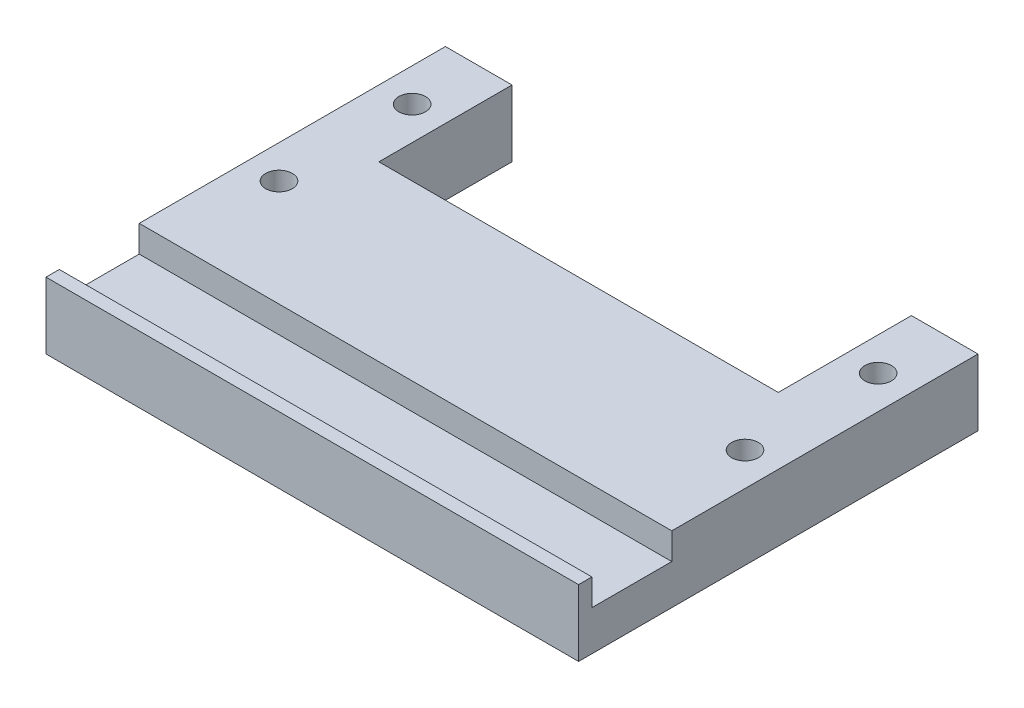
ISO-10303-21;
HEADER;
FILE_DESCRIPTION(('STEP AP214'),'2;1');
FILE_NAME('part.step','',(''),(''),'','','');
FILE_SCHEMA(('AUTOMOTIVE_DESIGN { 1 0 10303 214 1 1 1 1 }'));
ENDSEC;
DATA;
#1=APPLICATION_CONTEXT('core data for automotive mechanical design processes');
#2=APPLICATION_PROTOCOL_DEFINITION('international standard','automotive_design',2000,#1);
#3=PRODUCT_CONTEXT('',#1,'mechanical');
#4=PRODUCT('Part','Part','',(#3));
#5=PRODUCT_RELATED_PRODUCT_CATEGORY('part','',(#4));
#6=PRODUCT_DEFINITION_FORMATION('','',#4);
#7=PRODUCT_DEFINITION_CONTEXT('part definition',#1,'design');
#8=PRODUCT_DEFINITION('design','',#6,#7);
#9=PRODUCT_DEFINITION_SHAPE('','',#8);
#10=(LENGTH_UNIT() NAMED_UNIT(*) SI_UNIT(.MILLI.,.METRE.));
#11=(NAMED_UNIT(*) PLANE_ANGLE_UNIT() SI_UNIT($,.RADIAN.));
#12=(NAMED_UNIT(*) SI_UNIT($,.STERADIAN.) SOLID_ANGLE_UNIT());
#13=UNCERTAINTY_MEASURE_WITH_UNIT(LENGTH_MEASURE(1.E-05),#10,'distance_accuracy_value','');
#14=(GEOMETRIC_REPRESENTATION_CONTEXT(3) GLOBAL_UNCERTAINTY_ASSIGNED_CONTEXT((#13)) GLOBAL_UNIT_ASSIGNED_CONTEXT((#10,
#11,#12)) REPRESENTATION_CONTEXT('',''));
#15=CARTESIAN_POINT('',(0.,0.,0.));
#16=DIRECTION('',(0.,0.,1.));
#17=DIRECTION('',(1.,0.,0.));
#18=AXIS2_PLACEMENT_3D('',#15,#16,#17);
#19=CARTESIAN_POINT('',(0.,6.35,0.));
#20=DIRECTION('',(0.,1.,0.));
#21=DIRECTION('',(0.,0.,1.));
#22=AXIS2_PLACEMENT_3D('',#19,#20,#21);
#23=PLANE('',#22);
#24=DIRECTION('',(1.,0.,0.));
#25=VECTOR('',#24,1.);
#26=CARTESIAN_POINT('',(0.,6.35,11.43));
#27=LINE('',#26,#25);
#28=CARTESIAN_POINT('',(-25.4,6.35,11.43));
#29=VERTEX_POINT('',#28);
#30=CARTESIAN_POINT('',(25.4,6.35,11.43));
#31=VERTEX_POINT('',#30);
#32=EDGE_CURVE('E44',#29,#31,#27,.T.);
#33=ORIENTED_EDGE('',*,*,#32,.F.);
#34=DIRECTION('',(0.,0.,1.));
#35=VECTOR('',#34,1.);
#36=CARTESIAN_POINT('',(-25.4,6.35,-12.7));
#37=LINE('',#36,#35);
#38=CARTESIAN_POINT('',(-25.4,6.35,12.7));
#39=VERTEX_POINT('',#38);
#40=EDGE_CURVE('E275',#29,#39,#37,.T.);
#41=ORIENTED_EDGE('',*,*,#40,.T.);
#42=DIRECTION('',(1.,0.,0.));
#43=VECTOR('',#42,1.);
#44=CARTESIAN_POINT('',(-25.4,6.35,12.7));
#45=LINE('',#44,#43);
#46=CARTESIAN_POINT('',(25.4,6.35,12.7));
#47=VERTEX_POINT('',#46);
#48=EDGE_CURVE('E279',#39,#47,#45,.T.);
#49=ORIENTED_EDGE('',*,*,#48,.T.);
#50=DIRECTION('',(0.,0.,-1.));
#51=VECTOR('',#50,1.);
#52=CARTESIAN_POINT('',(25.4,6.35,-12.7));
#53=LINE('',#52,#51);
#54=EDGE_CURVE('E268',#47,#31,#53,.T.);
#55=ORIENTED_EDGE('',*,*,#54,.T.);
#56=EDGE_LOOP('',(#33,#41,#49,#55));
#57=FACE_BOUND('',#56,.T.);
#58=ADVANCED_FACE('F36',(#57),#23,.T.);
#59=CARTESIAN_POINT('',(-25.4,6.35,-12.7));
#60=DIRECTION('',(0.,0.,1.));
#61=DIRECTION('',(1.,0.,0.));
#62=AXIS2_PLACEMENT_3D('',#59,#60,#61);
#63=PLANE('',#62);
#64=DIRECTION('',(0.,-1.,0.));
#65=VECTOR('',#64,1.);
#66=CARTESIAN_POINT('',(-19.05,6.35,-12.7));
#67=LINE('',#66,#65);
#68=CARTESIAN_POINT('',(-19.05,6.35,-12.7));
#69=VERTEX_POINT('',#68);
#70=CARTESIAN_POINT('',(-19.05,0.,-12.7));
#71=VERTEX_POINT('',#70);
#72=EDGE_CURVE('E227',#69,#71,#67,.T.);
#73=ORIENTED_EDGE('',*,*,#72,.F.);
#74=DIRECTION('',(-1.,0.,0.));
#75=VECTOR('',#74,1.);
#76=CARTESIAN_POINT('',(-25.4,6.35,-12.7));
#77=LINE('',#76,#75);
#78=CARTESIAN_POINT('',(19.05,6.35,-12.7));
#79=VERTEX_POINT('',#78);
#80=EDGE_CURVE('E271',#79,#69,#77,.T.);
#81=ORIENTED_EDGE('',*,*,#80,.F.);
#82=DIRECTION('',(0.,1.,0.));
#83=VECTOR('',#82,1.);
#84=CARTESIAN_POINT('',(19.05,6.35,-12.7));
#85=LINE('',#84,#83);
#86=CARTESIAN_POINT('',(19.05,0.,-12.7));
#87=VERTEX_POINT('',#86);
#88=EDGE_CURVE('E248',#87,#79,#85,.T.);
#89=ORIENTED_EDGE('',*,*,#88,.F.);
#90=DIRECTION('',(-1.,0.,0.));
#91=VECTOR('',#90,1.);
#92=CARTESIAN_POINT('',(-25.4,0.,-12.7));
#93=LINE('',#92,#91);
#94=EDGE_CURVE('E283',#87,#71,#93,.T.);
#95=ORIENTED_EDGE('',*,*,#94,.T.);
#96=EDGE_LOOP('',(#73,#81,#89,#95));
#97=FACE_BOUND('',#96,.T.);
#98=ADVANCED_FACE('F346',(#97),#63,.F.);
#99=CARTESIAN_POINT('',(25.4,6.35,-12.7));
#100=DIRECTION('',(-1.,0.,0.));
#101=DIRECTION('',(0.,0.,1.));
#102=AXIS2_PLACEMENT_3D('',#99,#100,#101);
#103=PLANE('',#102);
#104=DIRECTION('',(0.,0.,-1.));
#105=VECTOR('',#104,1.);
#106=CARTESIAN_POINT('',(25.4,3.81,-12.7));
#107=LINE('',#106,#105);
#108=CARTESIAN_POINT('',(25.4,3.81,11.43));
#109=VERTEX_POINT('',#108);
#110=CARTESIAN_POINT('',(25.4,3.81,3.81));
#111=VERTEX_POINT('',#110);
#112=EDGE_CURVE('E203',#109,#111,#107,.T.);
#113=ORIENTED_EDGE('',*,*,#112,.F.);
#114=DIRECTION('',(0.,1.,0.));
#115=VECTOR('',#114,1.);
#116=CARTESIAN_POINT('',(25.4,6.35,11.43));
#117=LINE('',#116,#115);
#118=EDGE_CURVE('E200',#109,#31,#117,.T.);
#119=ORIENTED_EDGE('',*,*,#118,.T.);
#120=ORIENTED_EDGE('',*,*,#54,.F.);
#121=DIRECTION('',(0.,-1.,0.));
#122=VECTOR('',#121,1.);
#123=CARTESIAN_POINT('',(25.4,6.35,12.7));
#124=LINE('',#123,#122);
#125=CARTESIAN_POINT('',(25.4,0.,12.7));
#126=VERTEX_POINT('',#125);
#127=EDGE_CURVE('E281',#47,#126,#124,.T.);
#128=ORIENTED_EDGE('',*,*,#127,.T.);
#129=DIRECTION('',(0.,0.,-1.));
#130=VECTOR('',#129,1.);
#131=CARTESIAN_POINT('',(25.4,0.,-12.7));
#132=LINE('',#131,#130);
#133=CARTESIAN_POINT('',(25.4,0.,-25.4));
#134=VERTEX_POINT('',#133);
#135=EDGE_CURVE('E267',#126,#134,#132,.T.);
#136=ORIENTED_EDGE('',*,*,#135,.T.);
#137=DIRECTION('',(0.,-1.,0.));
#138=VECTOR('',#137,1.);
#139=CARTESIAN_POINT('',(25.4,6.35,-25.4));
#140=LINE('',#139,#138);
#141=CARTESIAN_POINT('',(25.4,6.35,-25.4));
#142=VERTEX_POINT('',#141);
#143=EDGE_CURVE('E249',#142,#134,#140,.T.);
#144=ORIENTED_EDGE('',*,*,#143,.F.);
#145=CARTESIAN_POINT('',(25.4,6.35,3.80999999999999));
#146=VERTEX_POINT('',#145);
#147=EDGE_CURVE('E272',#146,#142,#53,.T.);
#148=ORIENTED_EDGE('',*,*,#147,.F.);
#149=DIRECTION('',(0.,-1.,0.));
#150=VECTOR('',#149,1.);
#151=CARTESIAN_POINT('',(25.4,6.35,3.81));
#152=LINE('',#151,#150);
#153=EDGE_CURVE('E59',#146,#111,#152,.T.);
#154=ORIENTED_EDGE('',*,*,#153,.T.);
#155=EDGE_LOOP('',(#113,#119,#120,#128,#136,#144,#148,#154));
#156=FACE_BOUND('',#155,.T.);
#157=ADVANCED_FACE('F38',(#156),#103,.F.);
#158=CARTESIAN_POINT('',(-25.4,6.35,-12.7));
#159=DIRECTION('',(1.,0.,0.));
#160=DIRECTION('',(0.,0.,-1.));
#161=AXIS2_PLACEMENT_3D('',#158,#159,#160);
#162=PLANE('',#161);
#163=ORIENTED_EDGE('',*,*,#40,.F.);
#164=DIRECTION('',(0.,-1.,0.));
#165=VECTOR('',#164,1.);
#166=CARTESIAN_POINT('',(-25.4,6.35,11.43));
#167=LINE('',#166,#165);
#168=CARTESIAN_POINT('',(-25.4,3.81,11.43));
#169=VERTEX_POINT('',#168);
#170=EDGE_CURVE('E197',#29,#169,#167,.T.);
#171=ORIENTED_EDGE('',*,*,#170,.T.);
#172=DIRECTION('',(0.,0.,1.));
#173=VECTOR('',#172,1.);
#174=CARTESIAN_POINT('',(-25.4,3.81,-12.7));
#175=LINE('',#174,#173);
#176=CARTESIAN_POINT('',(-25.4,3.81,3.81));
#177=VERTEX_POINT('',#176);
#178=EDGE_CURVE('E12',#177,#169,#175,.T.);
#179=ORIENTED_EDGE('',*,*,#178,.F.);
#180=DIRECTION('',(0.,1.,0.));
#181=VECTOR('',#180,1.);
#182=CARTESIAN_POINT('',(-25.4,6.35,3.81));
#183=LINE('',#182,#181);
#184=CARTESIAN_POINT('',(-25.4,6.35,3.81));
#185=VERTEX_POINT('',#184);
#186=EDGE_CURVE('E193',#177,#185,#183,.T.);
#187=ORIENTED_EDGE('',*,*,#186,.T.);
#188=CARTESIAN_POINT('',(-25.4,6.35,-25.4));
#189=VERTEX_POINT('',#188);
#190=EDGE_CURVE('E276',#189,#185,#37,.T.);
#191=ORIENTED_EDGE('',*,*,#190,.F.);
#192=DIRECTION('',(0.,1.,0.));
#193=VECTOR('',#192,1.);
#194=CARTESIAN_POINT('',(-25.4,6.35,-25.4));
#195=LINE('',#194,#193);
#196=CARTESIAN_POINT('',(-25.4,0.,-25.4));
#197=VERTEX_POINT('',#196);
#198=EDGE_CURVE('E230',#197,#189,#195,.T.);
#199=ORIENTED_EDGE('',*,*,#198,.F.);
#200=DIRECTION('',(0.,0.,1.));
#201=VECTOR('',#200,1.);
#202=CARTESIAN_POINT('',(-25.4,0.,-12.7));
#203=LINE('',#202,#201);
#204=CARTESIAN_POINT('',(-25.4,0.,12.7));
#205=VERTEX_POINT('',#204);
#206=EDGE_CURVE('E285',#197,#205,#203,.T.);
#207=ORIENTED_EDGE('',*,*,#206,.T.);
#208=DIRECTION('',(0.,-1.,0.));
#209=VECTOR('',#208,1.);
#210=CARTESIAN_POINT('',(-25.4,6.35,12.7));
#211=LINE('',#210,#209);
#212=EDGE_CURVE('E291',#39,#205,#211,.T.);
#213=ORIENTED_EDGE('',*,*,#212,.F.);
#214=EDGE_LOOP('',(#163,#171,#179,#187,#191,#199,#207,#213));
#215=FACE_BOUND('',#214,.T.);
#216=ADVANCED_FACE('F329',(#215),#162,.F.);
#217=CARTESIAN_POINT('',(-25.4,6.35,12.7));
#218=DIRECTION('',(0.,0.,-1.));
#219=DIRECTION('',(-1.,0.,0.));
#220=AXIS2_PLACEMENT_3D('',#217,#218,#219);
#221=PLANE('',#220);
#222=DIRECTION('',(1.,0.,0.));
#223=VECTOR('',#222,1.);
#224=CARTESIAN_POINT('',(-25.4,0.,12.7));
#225=LINE('',#224,#223);
#226=EDGE_CURVE('E287',#205,#126,#225,.T.);
#227=ORIENTED_EDGE('',*,*,#226,.T.);
#228=ORIENTED_EDGE('',*,*,#127,.F.);
#229=ORIENTED_EDGE('',*,*,#48,.F.);
#230=ORIENTED_EDGE('',*,*,#212,.T.);
#231=EDGE_LOOP('',(#227,#228,#229,#230));
#232=FACE_BOUND('',#231,.T.);
#233=ADVANCED_FACE('F308',(#232),#221,.F.);
#234=DIRECTION('',(-1.,0.,0.));
#235=VECTOR('',#234,1.);
#236=CARTESIAN_POINT('',(0.,6.35,3.81));
#237=LINE('',#236,#235);
#238=EDGE_CURVE('E294',#146,#185,#237,.T.);
#239=ORIENTED_EDGE('',*,*,#238,.F.);
#240=ORIENTED_EDGE('',*,*,#147,.T.);
#241=DIRECTION('',(1.,0.,0.));
#242=VECTOR('',#241,1.);
#243=CARTESIAN_POINT('',(25.4,6.35,-25.4));
#244=LINE('',#243,#242);
#245=CARTESIAN_POINT('',(19.05,6.35,-25.4));
#246=VERTEX_POINT('',#245);
#247=EDGE_CURVE('E256',#246,#142,#244,.T.);
#248=ORIENTED_EDGE('',*,*,#247,.F.);
#249=DIRECTION('',(0.,0.,1.));
#250=VECTOR('',#249,1.);
#251=CARTESIAN_POINT('',(19.05,6.35,-25.4));
#252=LINE('',#251,#250);
#253=EDGE_CURVE('E259',#246,#79,#252,.T.);
#254=ORIENTED_EDGE('',*,*,#253,.T.);
#255=ORIENTED_EDGE('',*,*,#80,.T.);
#256=DIRECTION('',(0.,0.,1.));
#257=VECTOR('',#256,1.);
#258=CARTESIAN_POINT('',(-19.05,6.35,-25.4));
#259=LINE('',#258,#257);
#260=CARTESIAN_POINT('',(-19.05,6.35,-25.4));
#261=VERTEX_POINT('',#260);
#262=EDGE_CURVE('E245',#261,#69,#259,.T.);
#263=ORIENTED_EDGE('',*,*,#262,.F.);
#264=DIRECTION('',(1.,0.,0.));
#265=VECTOR('',#264,1.);
#266=CARTESIAN_POINT('',(-25.4,6.35,-25.4));
#267=LINE('',#266,#265);
#268=EDGE_CURVE('E233',#189,#261,#267,.T.);
#269=ORIENTED_EDGE('',*,*,#268,.F.);
#270=ORIENTED_EDGE('',*,*,#190,.T.);
#271=EDGE_LOOP('',(#239,#240,#248,#254,#255,#263,#269,#270));
#272=FACE_BOUND('',#271,.T.);
#273=CARTESIAN_POINT('',(-22.225,6.35,-19.05));
#274=DIRECTION('',(0.,1.,0.));
#275=DIRECTION('',(0.,0.,1.));
#276=AXIS2_PLACEMENT_3D('',#273,#274,#275);
#277=CIRCLE('',#276,1.27);
#278=CARTESIAN_POINT('',(-22.225,6.35,-17.78));
#279=VERTEX_POINT('',#278);
#280=EDGE_CURVE('E216',#279,#279,#277,.T.);
#281=ORIENTED_EDGE('',*,*,#280,.F.);
#282=EDGE_LOOP('',(#281));
#283=FACE_BOUND('',#282,.T.);
#284=CARTESIAN_POINT('',(22.225,6.35,-6.35));
#285=DIRECTION('',(0.,1.,0.));
#286=DIRECTION('',(0.,0.,-1.));
#287=AXIS2_PLACEMENT_3D('',#284,#285,#286);
#288=CIRCLE('',#287,1.27);
#289=CARTESIAN_POINT('',(22.225,6.35,-7.62));
#290=VERTEX_POINT('',#289);
#291=EDGE_CURVE('E209',#290,#290,#288,.T.);
#292=ORIENTED_EDGE('',*,*,#291,.F.);
#293=EDGE_LOOP('',(#292));
#294=FACE_BOUND('',#293,.T.);
#295=CARTESIAN_POINT('',(22.225,6.35,-19.05));
#296=DIRECTION('',(0.,1.,0.));
#297=DIRECTION('',(0.,0.,-1.));
#298=AXIS2_PLACEMENT_3D('',#295,#296,#297);
#299=CIRCLE('',#298,1.27);
#300=CARTESIAN_POINT('',(22.225,6.35,-20.32));
#301=VERTEX_POINT('',#300);
#302=EDGE_CURVE('E205',#301,#301,#299,.T.);
#303=ORIENTED_EDGE('',*,*,#302,.F.);
#304=EDGE_LOOP('',(#303));
#305=FACE_BOUND('',#304,.T.);
#306=CARTESIAN_POINT('',(-22.225,6.35,-6.35));
#307=DIRECTION('',(0.,1.,0.));
#308=DIRECTION('',(0.,0.,1.));
#309=AXIS2_PLACEMENT_3D('',#306,#307,#308);
#310=CIRCLE('',#309,1.27);
#311=CARTESIAN_POINT('',(-22.225,6.35,-5.08));
#312=VERTEX_POINT('',#311);
#313=EDGE_CURVE('E215',#312,#312,#310,.T.);
#314=ORIENTED_EDGE('',*,*,#313,.F.);
#315=EDGE_LOOP('',(#314));
#316=FACE_BOUND('',#315,.T.);
#317=ADVANCED_FACE('F323',(#272,#283,#294,#305,#316),#23,.T.);
#318=CARTESIAN_POINT('',(0.,0.,0.));
#319=DIRECTION('',(0.,1.,0.));
#320=DIRECTION('',(0.,0.,1.));
#321=AXIS2_PLACEMENT_3D('',#318,#319,#320);
#322=PLANE('',#321);
#323=DIRECTION('',(0.,0.,1.));
#324=VECTOR('',#323,1.);
#325=CARTESIAN_POINT('',(20.32,0.,2.54));
#326=LINE('',#325,#324);
#327=CARTESIAN_POINT('',(20.32,0.,-11.43));
#328=VERTEX_POINT('',#327);
#329=CARTESIAN_POINT('',(20.32,0.,2.54));
#330=VERTEX_POINT('',#329);
#331=EDGE_CURVE('E173',#328,#330,#326,.T.);
#332=ORIENTED_EDGE('',*,*,#331,.F.);
#333=DIRECTION('',(1.,0.,0.));
#334=VECTOR('',#333,1.);
#335=CARTESIAN_POINT('',(-20.32,0.,-11.43));
#336=LINE('',#335,#334);
#337=CARTESIAN_POINT('',(-20.32,0.,-11.43));
#338=VERTEX_POINT('',#337);
#339=EDGE_CURVE('E166',#338,#328,#336,.T.);
#340=ORIENTED_EDGE('',*,*,#339,.F.);
#341=DIRECTION('',(0.,0.,-1.));
#342=VECTOR('',#341,1.);
#343=CARTESIAN_POINT('',(-20.32,0.,2.54));
#344=LINE('',#343,#342);
#345=CARTESIAN_POINT('',(-20.32,0.,2.54));
#346=VERTEX_POINT('',#345);
#347=EDGE_CURVE('E177',#346,#338,#344,.T.);
#348=ORIENTED_EDGE('',*,*,#347,.F.);
#349=DIRECTION('',(-1.,0.,0.));
#350=VECTOR('',#349,1.);
#351=CARTESIAN_POINT('',(-20.32,0.,2.54));
#352=LINE('',#351,#350);
#353=EDGE_CURVE('E51',#330,#346,#352,.T.);
#354=ORIENTED_EDGE('',*,*,#353,.F.);
#355=EDGE_LOOP('',(#332,#340,#348,#354));
#356=FACE_BOUND('',#355,.T.);
#357=CARTESIAN_POINT('',(-22.225,0.,-19.05));
#358=DIRECTION('',(0.,1.,0.));
#359=DIRECTION('',(0.,0.,1.));
#360=AXIS2_PLACEMENT_3D('',#357,#358,#359);
#361=CIRCLE('',#360,1.27);
#362=CARTESIAN_POINT('',(-22.225,0.,-17.78));
#363=VERTEX_POINT('',#362);
#364=EDGE_CURVE('E212',#363,#363,#361,.T.);
#365=ORIENTED_EDGE('',*,*,#364,.T.);
#366=EDGE_LOOP('',(#365));
#367=FACE_BOUND('',#366,.T.);
#368=CARTESIAN_POINT('',(22.225,0.,-6.35));
#369=DIRECTION('',(0.,1.,0.));
#370=DIRECTION('',(0.,0.,-1.));
#371=AXIS2_PLACEMENT_3D('',#368,#369,#370);
#372=CIRCLE('',#371,1.27);
#373=CARTESIAN_POINT('',(22.225,0.,-7.62));
#374=VERTEX_POINT('',#373);
#375=EDGE_CURVE('E219',#374,#374,#372,.T.);
#376=ORIENTED_EDGE('',*,*,#375,.T.);
#377=EDGE_LOOP('',(#376));
#378=FACE_BOUND('',#377,.T.);
#379=CARTESIAN_POINT('',(22.225,0.,-19.05));
#380=DIRECTION('',(0.,1.,0.));
#381=DIRECTION('',(0.,0.,-1.));
#382=AXIS2_PLACEMENT_3D('',#379,#380,#381);
#383=CIRCLE('',#382,1.27);
#384=CARTESIAN_POINT('',(22.225,0.,-20.32));
#385=VERTEX_POINT('',#384);
#386=EDGE_CURVE('E206',#385,#385,#383,.T.);
#387=ORIENTED_EDGE('',*,*,#386,.T.);
#388=EDGE_LOOP('',(#387));
#389=FACE_BOUND('',#388,.T.);
#390=CARTESIAN_POINT('',(-22.225,0.,-6.35));
#391=DIRECTION('',(0.,1.,0.));
#392=DIRECTION('',(0.,0.,1.));
#393=AXIS2_PLACEMENT_3D('',#390,#391,#392);
#394=CIRCLE('',#393,1.27);
#395=CARTESIAN_POINT('',(-22.225,0.,-5.08));
#396=VERTEX_POINT('',#395);
#397=EDGE_CURVE('E224',#396,#396,#394,.T.);
#398=ORIENTED_EDGE('',*,*,#397,.T.);
#399=EDGE_LOOP('',(#398));
#400=FACE_BOUND('',#399,.T.);
#401=ORIENTED_EDGE('',*,*,#135,.F.);
#402=ORIENTED_EDGE('',*,*,#226,.F.);
#403=ORIENTED_EDGE('',*,*,#206,.F.);
#404=DIRECTION('',(-1.,0.,0.));
#405=VECTOR('',#404,1.);
#406=CARTESIAN_POINT('',(-25.4,0.,-25.4));
#407=LINE('',#406,#405);
#408=CARTESIAN_POINT('',(-19.05,0.,-25.4));
#409=VERTEX_POINT('',#408);
#410=EDGE_CURVE('E237',#409,#197,#407,.T.);
#411=ORIENTED_EDGE('',*,*,#410,.F.);
#412=DIRECTION('',(0.,0.,1.));
#413=VECTOR('',#412,1.);
#414=CARTESIAN_POINT('',(-19.05,0.,-25.4));
#415=LINE('',#414,#413);
#416=EDGE_CURVE('E240',#409,#71,#415,.T.);
#417=ORIENTED_EDGE('',*,*,#416,.T.);
#418=ORIENTED_EDGE('',*,*,#94,.F.);
#419=DIRECTION('',(0.,0.,1.));
#420=VECTOR('',#419,1.);
#421=CARTESIAN_POINT('',(19.05,0.,-25.4));
#422=LINE('',#421,#420);
#423=CARTESIAN_POINT('',(19.05,0.,-25.4));
#424=VERTEX_POINT('',#423);
#425=EDGE_CURVE('E264',#424,#87,#422,.T.);
#426=ORIENTED_EDGE('',*,*,#425,.F.);
#427=DIRECTION('',(-1.,0.,0.));
#428=VECTOR('',#427,1.);
#429=CARTESIAN_POINT('',(25.4,0.,-25.4));
#430=LINE('',#429,#428);
#431=EDGE_CURVE('E252',#134,#424,#430,.T.);
#432=ORIENTED_EDGE('',*,*,#431,.F.);
#433=EDGE_LOOP('',(#401,#402,#403,#411,#417,#418,#426,#432));
#434=FACE_BOUND('',#433,.T.);
#435=ADVANCED_FACE('F314',(#356,#367,#378,#389,#400,#434),#322,.F.);
#436=CARTESIAN_POINT('',(19.05,6.35,-25.4));
#437=DIRECTION('',(1.,0.,0.));
#438=DIRECTION('',(0.,0.,-1.));
#439=AXIS2_PLACEMENT_3D('',#436,#437,#438);
#440=PLANE('',#439);
#441=ORIENTED_EDGE('',*,*,#88,.T.);
#442=ORIENTED_EDGE('',*,*,#253,.F.);
#443=DIRECTION('',(0.,1.,0.));
#444=VECTOR('',#443,1.);
#445=CARTESIAN_POINT('',(19.05,6.35,-25.4));
#446=LINE('',#445,#444);
#447=EDGE_CURVE('E254',#424,#246,#446,.T.);
#448=ORIENTED_EDGE('',*,*,#447,.F.);
#449=ORIENTED_EDGE('',*,*,#425,.T.);
#450=EDGE_LOOP('',(#441,#442,#448,#449));
#451=FACE_BOUND('',#450,.T.);
#452=ADVANCED_FACE('F359',(#451),#440,.F.);
#453=CARTESIAN_POINT('',(0.,0.,-25.4));
#454=DIRECTION('',(0.,0.,-1.));
#455=DIRECTION('',(-1.,0.,0.));
#456=AXIS2_PLACEMENT_3D('',#453,#454,#455);
#457=PLANE('',#456);
#458=ORIENTED_EDGE('',*,*,#143,.T.);
#459=ORIENTED_EDGE('',*,*,#431,.T.);
#460=ORIENTED_EDGE('',*,*,#447,.T.);
#461=ORIENTED_EDGE('',*,*,#247,.T.);
#462=EDGE_LOOP('',(#458,#459,#460,#461));
#463=FACE_BOUND('',#462,.T.);
#464=ADVANCED_FACE('F319',(#463),#457,.T.);
#465=CARTESIAN_POINT('',(-19.05,6.35,-25.4));
#466=DIRECTION('',(-1.,0.,0.));
#467=DIRECTION('',(0.,0.,1.));
#468=AXIS2_PLACEMENT_3D('',#465,#466,#467);
#469=PLANE('',#468);
#470=ORIENTED_EDGE('',*,*,#72,.T.);
#471=ORIENTED_EDGE('',*,*,#416,.F.);
#472=DIRECTION('',(0.,-1.,0.));
#473=VECTOR('',#472,1.);
#474=CARTESIAN_POINT('',(-19.05,6.35,-25.4));
#475=LINE('',#474,#473);
#476=EDGE_CURVE('E235',#261,#409,#475,.T.);
#477=ORIENTED_EDGE('',*,*,#476,.F.);
#478=ORIENTED_EDGE('',*,*,#262,.T.);
#479=EDGE_LOOP('',(#470,#471,#477,#478));
#480=FACE_BOUND('',#479,.T.);
#481=ADVANCED_FACE('F396',(#480),#469,.F.);
#482=CARTESIAN_POINT('',(0.,0.,-25.4));
#483=DIRECTION('',(0.,0.,1.));
#484=DIRECTION('',(1.,0.,0.));
#485=AXIS2_PLACEMENT_3D('',#482,#483,#484);
#486=PLANE('',#485);
#487=ORIENTED_EDGE('',*,*,#198,.T.);
#488=ORIENTED_EDGE('',*,*,#268,.T.);
#489=ORIENTED_EDGE('',*,*,#476,.T.);
#490=ORIENTED_EDGE('',*,*,#410,.T.);
#491=EDGE_LOOP('',(#487,#488,#489,#490));
#492=FACE_BOUND('',#491,.T.);
#493=ADVANCED_FACE('F405',(#492),#486,.F.);
#494=CARTESIAN_POINT('',(-22.225,0.,-6.35));
#495=DIRECTION('',(0.,1.,0.));
#496=DIRECTION('',(0.,0.,1.));
#497=AXIS2_PLACEMENT_3D('',#494,#495,#496);
#498=CYLINDRICAL_SURFACE('',#497,1.27);
#499=ORIENTED_EDGE('',*,*,#397,.F.);
#500=EDGE_LOOP('',(#499));
#501=FACE_BOUND('',#500,.T.);
#502=ORIENTED_EDGE('',*,*,#313,.T.);
#503=EDGE_LOOP('',(#502));
#504=FACE_BOUND('',#503,.T.);
#505=ADVANCED_FACE('F415',(#501,#504),#498,.F.);
#506=CARTESIAN_POINT('',(22.225,0.,-19.05));
#507=DIRECTION('',(0.,1.,0.));
#508=DIRECTION('',(0.,0.,1.));
#509=AXIS2_PLACEMENT_3D('',#506,#507,#508);
#510=CYLINDRICAL_SURFACE('',#509,1.27);
#511=ORIENTED_EDGE('',*,*,#386,.F.);
#512=EDGE_LOOP('',(#511));
#513=FACE_BOUND('',#512,.T.);
#514=ORIENTED_EDGE('',*,*,#302,.T.);
#515=EDGE_LOOP('',(#514));
#516=FACE_BOUND('',#515,.T.);
#517=ADVANCED_FACE('F425',(#513,#516),#510,.F.);
#518=CARTESIAN_POINT('',(22.225,0.,-6.35));
#519=DIRECTION('',(0.,1.,0.));
#520=DIRECTION('',(0.,0.,1.));
#521=AXIS2_PLACEMENT_3D('',#518,#519,#520);
#522=CYLINDRICAL_SURFACE('',#521,1.27);
#523=ORIENTED_EDGE('',*,*,#375,.F.);
#524=EDGE_LOOP('',(#523));
#525=FACE_BOUND('',#524,.T.);
#526=ORIENTED_EDGE('',*,*,#291,.T.);
#527=EDGE_LOOP('',(#526));
#528=FACE_BOUND('',#527,.T.);
#529=ADVANCED_FACE('F341',(#525,#528),#522,.F.);
#530=CARTESIAN_POINT('',(-22.225,0.,-19.05));
#531=DIRECTION('',(0.,1.,0.));
#532=DIRECTION('',(0.,0.,1.));
#533=AXIS2_PLACEMENT_3D('',#530,#531,#532);
#534=CYLINDRICAL_SURFACE('',#533,1.27);
#535=ORIENTED_EDGE('',*,*,#364,.F.);
#536=EDGE_LOOP('',(#535));
#537=FACE_BOUND('',#536,.T.);
#538=ORIENTED_EDGE('',*,*,#280,.T.);
#539=EDGE_LOOP('',(#538));
#540=FACE_BOUND('',#539,.T.);
#541=ADVANCED_FACE('F334',(#537,#540),#534,.F.);
#542=CARTESIAN_POINT('',(0.,3.81,0.));
#543=DIRECTION('',(0.,1.,0.));
#544=DIRECTION('',(0.,0.,1.));
#545=AXIS2_PLACEMENT_3D('',#542,#543,#544);
#546=PLANE('',#545);
#547=ORIENTED_EDGE('',*,*,#112,.T.);
#548=DIRECTION('',(-1.,0.,0.));
#549=VECTOR('',#548,1.);
#550=CARTESIAN_POINT('',(-27.3245408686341,3.81,3.81));
#551=LINE('',#550,#549);
#552=EDGE_CURVE('E187',#111,#177,#551,.T.);
#553=ORIENTED_EDGE('',*,*,#552,.T.);
#554=ORIENTED_EDGE('',*,*,#178,.T.);
#555=DIRECTION('',(1.,0.,0.));
#556=VECTOR('',#555,1.);
#557=CARTESIAN_POINT('',(-27.3245408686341,3.81,11.43));
#558=LINE('',#557,#556);
#559=EDGE_CURVE('E190',#169,#109,#558,.T.);
#560=ORIENTED_EDGE('',*,*,#559,.T.);
#561=EDGE_LOOP('',(#547,#553,#554,#560));
#562=FACE_BOUND('',#561,.T.);
#563=ADVANCED_FACE('F332',(#562),#546,.T.);
#564=CARTESIAN_POINT('',(-27.3245408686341,3.81,11.43));
#565=DIRECTION('',(0.,0.,1.));
#566=DIRECTION('',(1.,0.,0.));
#567=AXIS2_PLACEMENT_3D('',#564,#565,#566);
#568=PLANE('',#567);
#569=ORIENTED_EDGE('',*,*,#559,.F.);
#570=ORIENTED_EDGE('',*,*,#170,.F.);
#571=ORIENTED_EDGE('',*,*,#32,.T.);
#572=ORIENTED_EDGE('',*,*,#118,.F.);
#573=EDGE_LOOP('',(#569,#570,#571,#572));
#574=FACE_BOUND('',#573,.T.);
#575=ADVANCED_FACE('F298',(#574),#568,.F.);
#576=CARTESIAN_POINT('',(-27.3245408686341,3.81,3.81));
#577=DIRECTION('',(0.,0.,-1.));
#578=DIRECTION('',(-1.,0.,0.));
#579=AXIS2_PLACEMENT_3D('',#576,#577,#578);
#580=PLANE('',#579);
#581=ORIENTED_EDGE('',*,*,#238,.T.);
#582=ORIENTED_EDGE('',*,*,#186,.F.);
#583=ORIENTED_EDGE('',*,*,#552,.F.);
#584=ORIENTED_EDGE('',*,*,#153,.F.);
#585=EDGE_LOOP('',(#581,#582,#583,#584));
#586=FACE_BOUND('',#585,.T.);
#587=ADVANCED_FACE('F326',(#586),#580,.F.);
#588=CARTESIAN_POINT('',(0.,5.08,0.));
#589=DIRECTION('',(0.,1.,0.));
#590=DIRECTION('',(0.,0.,1.));
#591=AXIS2_PLACEMENT_3D('',#588,#589,#590);
#592=PLANE('',#591);
#593=DIRECTION('',(0.,0.,-1.));
#594=VECTOR('',#593,1.);
#595=CARTESIAN_POINT('',(-20.32,5.08,2.54));
#596=LINE('',#595,#594);
#597=CARTESIAN_POINT('',(-20.32,5.08,2.54));
#598=VERTEX_POINT('',#597);
#599=CARTESIAN_POINT('',(-20.32,5.08,-11.43));
#600=VERTEX_POINT('',#599);
#601=EDGE_CURVE('E170',#598,#600,#596,.T.);
#602=ORIENTED_EDGE('',*,*,#601,.T.);
#603=DIRECTION('',(1.,0.,0.));
#604=VECTOR('',#603,1.);
#605=CARTESIAN_POINT('',(-20.32,5.08,-11.43));
#606=LINE('',#605,#604);
#607=CARTESIAN_POINT('',(20.32,5.08,-11.43));
#608=VERTEX_POINT('',#607);
#609=EDGE_CURVE('E163',#600,#608,#606,.T.);
#610=ORIENTED_EDGE('',*,*,#609,.T.);
#611=DIRECTION('',(0.,0.,1.));
#612=VECTOR('',#611,1.);
#613=CARTESIAN_POINT('',(20.32,5.08,2.54));
#614=LINE('',#613,#612);
#615=CARTESIAN_POINT('',(20.32,5.08,2.54));
#616=VERTEX_POINT('',#615);
#617=EDGE_CURVE('E150',#608,#616,#614,.T.);
#618=ORIENTED_EDGE('',*,*,#617,.T.);
#619=DIRECTION('',(-1.,0.,0.));
#620=VECTOR('',#619,1.);
#621=CARTESIAN_POINT('',(-20.32,5.08,2.54));
#622=LINE('',#621,#620);
#623=EDGE_CURVE('E182',#616,#598,#622,.T.);
#624=ORIENTED_EDGE('',*,*,#623,.T.);
#625=EDGE_LOOP('',(#602,#610,#618,#624));
#626=FACE_BOUND('',#625,.T.);
#627=ADVANCED_FACE('F169',(#626),#592,.F.);
#628=CARTESIAN_POINT('',(-20.32,49.3240677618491,-11.43));
#629=DIRECTION('',(0.,0.,-1.));
#630=DIRECTION('',(-1.,0.,0.));
#631=AXIS2_PLACEMENT_3D('',#628,#629,#630);
#632=PLANE('',#631);
#633=DIRECTION('',(0.,-1.,0.));
#634=VECTOR('',#633,1.);
#635=CARTESIAN_POINT('',(-20.32,49.3240677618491,-11.43));
#636=LINE('',#635,#634);
#637=EDGE_CURVE('E180',#600,#338,#636,.T.);
#638=ORIENTED_EDGE('',*,*,#637,.T.);
#639=ORIENTED_EDGE('',*,*,#339,.T.);
#640=DIRECTION('',(0.,-1.,0.));
#641=VECTOR('',#640,1.);
#642=CARTESIAN_POINT('',(20.32,49.3240677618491,-11.43));
#643=LINE('',#642,#641);
#644=EDGE_CURVE('E154',#608,#328,#643,.T.);
#645=ORIENTED_EDGE('',*,*,#644,.F.);
#646=ORIENTED_EDGE('',*,*,#609,.F.);
#647=EDGE_LOOP('',(#638,#639,#645,#646));
#648=FACE_BOUND('',#647,.T.);
#649=ADVANCED_FACE('F162',(#648),#632,.F.);
#650=CARTESIAN_POINT('',(20.32,49.3240677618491,2.54));
#651=DIRECTION('',(1.,0.,0.));
#652=DIRECTION('',(0.,0.,-1.));
#653=AXIS2_PLACEMENT_3D('',#650,#651,#652);
#654=PLANE('',#653);
#655=ORIENTED_EDGE('',*,*,#644,.T.);
#656=ORIENTED_EDGE('',*,*,#331,.T.);
#657=DIRECTION('',(0.,-1.,0.));
#658=VECTOR('',#657,1.);
#659=CARTESIAN_POINT('',(20.32,49.3240677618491,2.54));
#660=LINE('',#659,#658);
#661=EDGE_CURVE('E156',#616,#330,#660,.T.);
#662=ORIENTED_EDGE('',*,*,#661,.F.);
#663=ORIENTED_EDGE('',*,*,#617,.F.);
#664=EDGE_LOOP('',(#655,#656,#662,#663));
#665=FACE_BOUND('',#664,.T.);
#666=ADVANCED_FACE('F152',(#665),#654,.F.);
#667=CARTESIAN_POINT('',(-20.32,49.3240677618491,2.54));
#668=DIRECTION('',(0.,0.,1.));
#669=DIRECTION('',(1.,0.,0.));
#670=AXIS2_PLACEMENT_3D('',#667,#668,#669);
#671=PLANE('',#670);
#672=ORIENTED_EDGE('',*,*,#661,.T.);
#673=ORIENTED_EDGE('',*,*,#353,.T.);
#674=DIRECTION('',(0.,-1.,0.));
#675=VECTOR('',#674,1.);
#676=CARTESIAN_POINT('',(-20.32,49.3240677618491,2.54));
#677=LINE('',#676,#675);
#678=EDGE_CURVE('E181',#598,#346,#677,.T.);
#679=ORIENTED_EDGE('',*,*,#678,.F.);
#680=ORIENTED_EDGE('',*,*,#623,.F.);
#681=EDGE_LOOP('',(#672,#673,#679,#680));
#682=FACE_BOUND('',#681,.T.);
#683=ADVANCED_FACE('F498',(#682),#671,.F.);
#684=CARTESIAN_POINT('',(-20.32,49.3240677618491,2.54));
#685=DIRECTION('',(-1.,0.,0.));
#686=DIRECTION('',(0.,0.,1.));
#687=AXIS2_PLACEMENT_3D('',#684,#685,#686);
#688=PLANE('',#687);
#689=ORIENTED_EDGE('',*,*,#678,.T.);
#690=ORIENTED_EDGE('',*,*,#347,.T.);
#691=ORIENTED_EDGE('',*,*,#637,.F.);
#692=ORIENTED_EDGE('',*,*,#601,.F.);
#693=EDGE_LOOP('',(#689,#690,#691,#692));
#694=FACE_BOUND('',#693,.T.);
#695=ADVANCED_FACE('F506',(#694),#688,.F.);
#696=CLOSED_SHELL('',(#58,#98,#157,#216,#233,#317,#435,#452,#464,#481,#493,#505,#517,#529,#541,
#563,#575,#587,#627,#649,#666,#683,#695));
#697=MANIFOLD_SOLID_BREP('B2',#696);
#698=ADVANCED_BREP_SHAPE_REPRESENTATION('',(#18,#697),#14);
#699=SHAPE_DEFINITION_REPRESENTATION(#9,#698);
ENDSEC;
END-ISO-10303-21;
